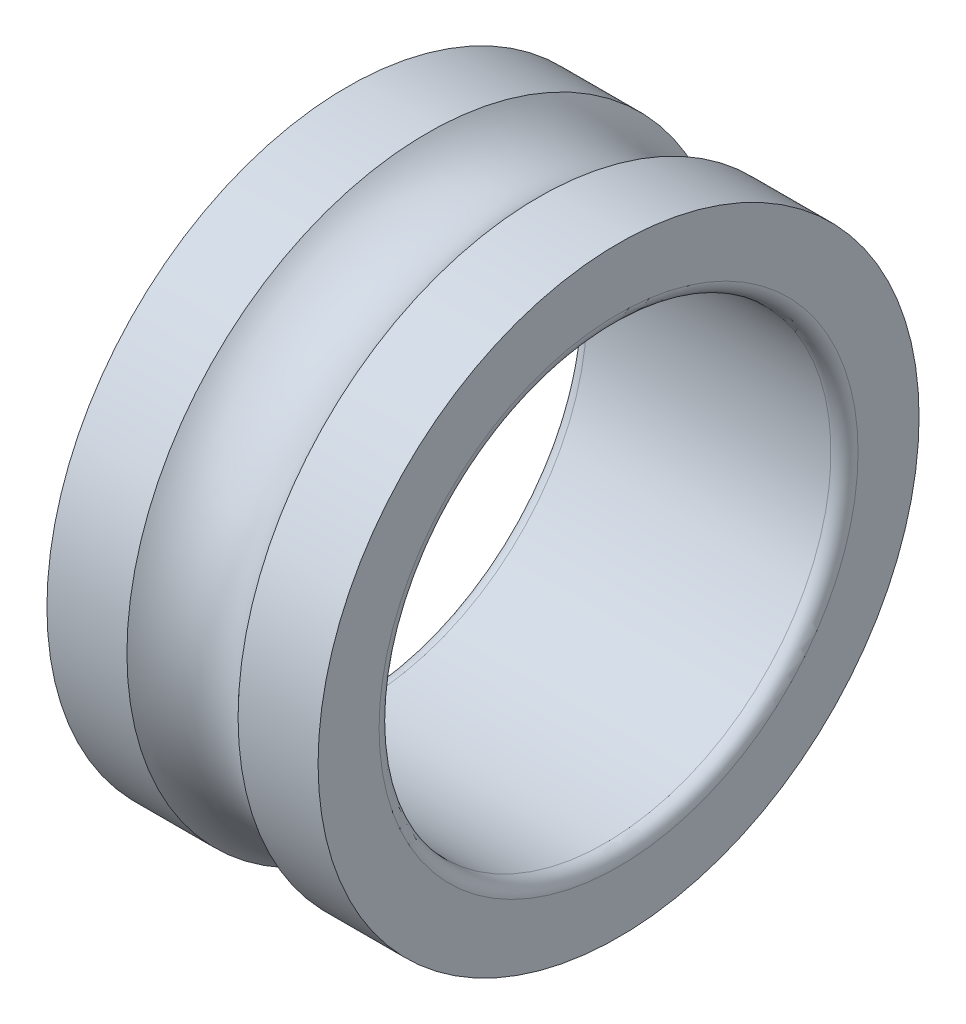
from build123d import *


with BuildPart() as part:
    # Esquisse1 → Base-R_volution (revolve)
    with BuildSketch(Plane(origin=(0, 0, 0), x_dir=(1, 0, 0), z_dir=(0, 1, 0)), mode=Mode.PRIVATE) as base_r_volution_sk:
        with BuildLine():
            Line((0, 13.3), (0, 10.6))
            ThreePointArc((0, 10.6), (0.175735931, 10.175735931), (0.6, 10))
            Line((0.6, 10), (11.4, 10))
            ThreePointArc((11.4, 10), (11.824264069, 10.175735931), (12, 10.6))
            Line((12, 10.6), (12, 13.3))
            Line((12, 13.3), (8.459674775, 13.3))
            ThreePointArc((8.459674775, 13.3), (6, 12.2), (3.540325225, 13.3))
            Line((3.540325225, 13.3), (0, 13.3))
        make_face()
    revolve(base_r_volution_sk.sketch.rotate(Axis((0, 0, 0), (1, 0, 0)), 180), axis=Axis((0, 0, 0), (1, 0, 0)))


solid = part.part
